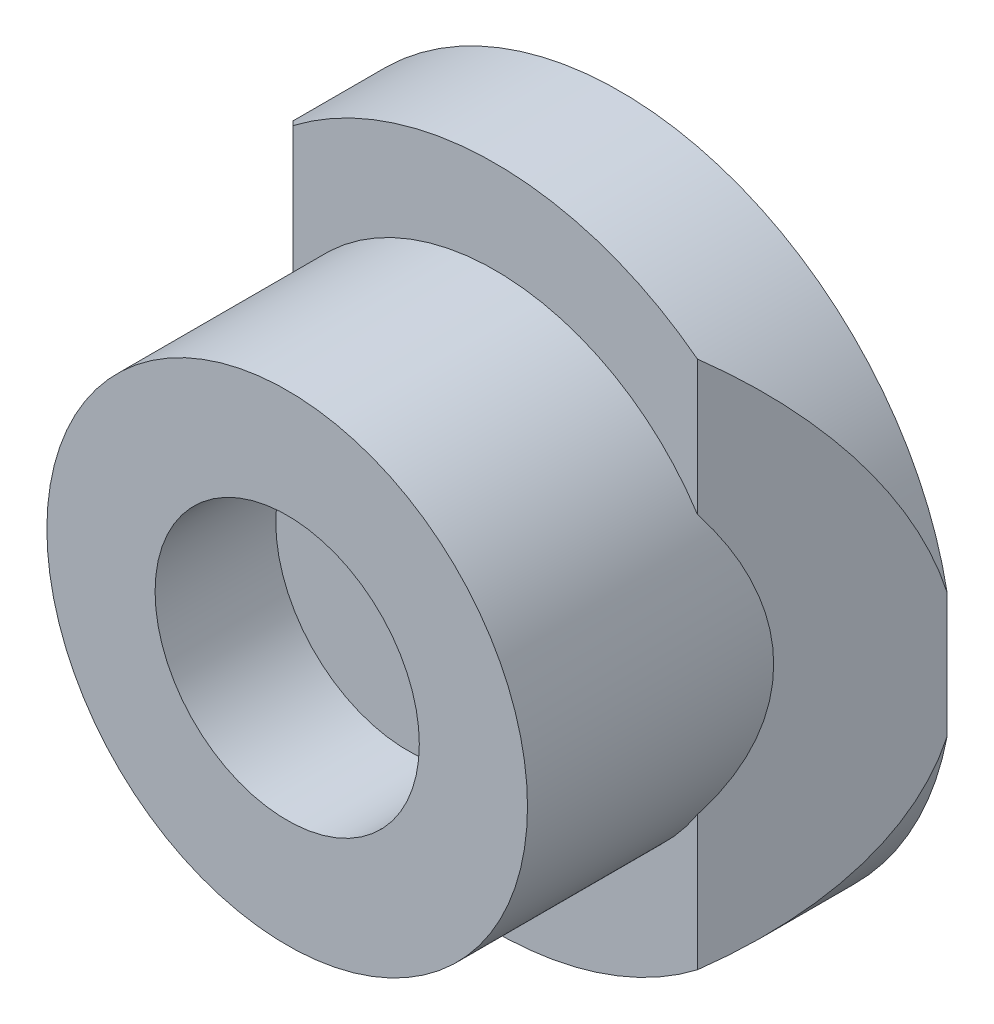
ISO-10303-21;
HEADER;
FILE_DESCRIPTION(('STEP AP214'),'2;1');
FILE_NAME('part.step','',(''),(''),'','','');
FILE_SCHEMA(('AUTOMOTIVE_DESIGN { 1 0 10303 214 1 1 1 1 }'));
ENDSEC;
DATA;
#1=APPLICATION_CONTEXT('core data for automotive mechanical design processes');
#2=APPLICATION_PROTOCOL_DEFINITION('international standard','automotive_design',2000,#1);
#3=PRODUCT_CONTEXT('',#1,'mechanical');
#4=PRODUCT('Part','Part','',(#3));
#5=PRODUCT_RELATED_PRODUCT_CATEGORY('part','',(#4));
#6=PRODUCT_DEFINITION_FORMATION('','',#4);
#7=PRODUCT_DEFINITION_CONTEXT('part definition',#1,'design');
#8=PRODUCT_DEFINITION('design','',#6,#7);
#9=PRODUCT_DEFINITION_SHAPE('','',#8);
#10=(LENGTH_UNIT() NAMED_UNIT(*) SI_UNIT(.MILLI.,.METRE.));
#11=(NAMED_UNIT(*) PLANE_ANGLE_UNIT() SI_UNIT($,.RADIAN.));
#12=(NAMED_UNIT(*) SI_UNIT($,.STERADIAN.) SOLID_ANGLE_UNIT());
#13=UNCERTAINTY_MEASURE_WITH_UNIT(LENGTH_MEASURE(1.E-05),#10,'distance_accuracy_value','');
#14=(GEOMETRIC_REPRESENTATION_CONTEXT(3) GLOBAL_UNCERTAINTY_ASSIGNED_CONTEXT((#13)) GLOBAL_UNIT_ASSIGNED_CONTEXT((#10,
#11,#12)) REPRESENTATION_CONTEXT('',''));
#15=CARTESIAN_POINT('',(0.,0.,0.));
#16=DIRECTION('',(0.,0.,1.));
#17=DIRECTION('',(1.,0.,0.));
#18=AXIS2_PLACEMENT_3D('',#15,#16,#17);
#19=CARTESIAN_POINT('',(0.,0.,-3.));
#20=DIRECTION('',(0.,0.,1.));
#21=DIRECTION('',(1.,0.,0.));
#22=AXIS2_PLACEMENT_3D('',#19,#20,#21);
#23=CYLINDRICAL_SURFACE('',#22,8.);
#24=CARTESIAN_POINT('',(0.,0.,4.85857864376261));
#25=DIRECTION('',(0.707106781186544,0.,-0.707106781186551));
#26=DIRECTION('',(0.707106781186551,0.,0.707106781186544));
#27=AXIS2_PLACEMENT_3D('',#24,#25,#26);
#28=ELLIPSE('',#27,11.3137084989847,8.);
#29=CARTESIAN_POINT('',(-7.85857864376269,-1.49757861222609,-3.));
#30=VERTEX_POINT('',#29);
#31=CARTESIAN_POINT('',(-4.85857864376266,-6.35564422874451,0.));
#32=VERTEX_POINT('',#31);
#33=EDGE_CURVE('E112',#30,#32,#28,.F.);
#34=ORIENTED_EDGE('',*,*,#33,.F.);
#35=CARTESIAN_POINT('',(0.,0.,-3.));
#36=DIRECTION('',(0.,0.,1.));
#37=DIRECTION('',(1.,0.,0.));
#38=AXIS2_PLACEMENT_3D('',#35,#36,#37);
#39=CIRCLE('',#38,8.);
#40=CARTESIAN_POINT('',(7.85857864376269,-1.49757861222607,-3.));
#41=VERTEX_POINT('',#40);
#42=EDGE_CURVE('E124',#30,#41,#39,.T.);
#43=ORIENTED_EDGE('',*,*,#42,.T.);
#44=CARTESIAN_POINT('',(0.,0.,4.85857864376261));
#45=DIRECTION('',(-0.707106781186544,0.,-0.707106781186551));
#46=DIRECTION('',(-0.707106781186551,0.,0.707106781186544));
#47=AXIS2_PLACEMENT_3D('',#44,#45,#46);
#48=ELLIPSE('',#47,11.3137084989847,8.);
#49=CARTESIAN_POINT('',(4.85857864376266,-6.35564422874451,0.));
#50=VERTEX_POINT('',#49);
#51=EDGE_CURVE('E119',#50,#41,#48,.F.);
#52=ORIENTED_EDGE('',*,*,#51,.F.);
#53=CARTESIAN_POINT('',(0.,0.,0.));
#54=DIRECTION('',(0.,0.,1.));
#55=DIRECTION('',(1.,0.,0.));
#56=AXIS2_PLACEMENT_3D('',#53,#54,#55);
#57=CIRCLE('',#56,8.);
#58=EDGE_CURVE('E117',#32,#50,#57,.T.);
#59=ORIENTED_EDGE('',*,*,#58,.F.);
#60=EDGE_LOOP('',(#34,#43,#52,#59));
#61=FACE_BOUND('',#60,.T.);
#62=ADVANCED_FACE('F33',(#61),#23,.T.);
#63=CARTESIAN_POINT('',(0.,0.,0.));
#64=DIRECTION('',(0.,0.,1.));
#65=DIRECTION('',(1.,0.,0.));
#66=AXIS2_PLACEMENT_3D('',#63,#64,#65);
#67=PLANE('',#66);
#68=DIRECTION('',(0.,1.,0.));
#69=VECTOR('',#68,1.);
#70=CARTESIAN_POINT('',(-4.85857864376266,0.,0.));
#71=LINE('',#70,#69);
#72=CARTESIAN_POINT('',(-4.85857864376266,-3.12167239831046,0.));
#73=VERTEX_POINT('',#72);
#74=EDGE_CURVE('E41',#32,#73,#71,.T.);
#75=ORIENTED_EDGE('',*,*,#74,.F.);
#76=ORIENTED_EDGE('',*,*,#58,.T.);
#77=DIRECTION('',(0.,-1.,0.));
#78=VECTOR('',#77,1.);
#79=CARTESIAN_POINT('',(4.85857864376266,0.,0.));
#80=LINE('',#79,#78);
#81=CARTESIAN_POINT('',(4.85857864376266,-3.12167239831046,0.));
#82=VERTEX_POINT('',#81);
#83=EDGE_CURVE('E99',#82,#50,#80,.T.);
#84=ORIENTED_EDGE('',*,*,#83,.F.);
#85=CARTESIAN_POINT('',(0.,0.,0.));
#86=DIRECTION('',(0.,0.,1.));
#87=DIRECTION('',(1.,0.,0.));
#88=AXIS2_PLACEMENT_3D('',#85,#86,#87);
#89=CIRCLE('',#88,5.775);
#90=EDGE_CURVE('E87',#73,#82,#89,.T.);
#91=ORIENTED_EDGE('',*,*,#90,.F.);
#92=EDGE_LOOP('',(#75,#76,#84,#91));
#93=FACE_BOUND('',#92,.T.);
#94=ADVANCED_FACE('F116',(#93),#67,.T.);
#95=CARTESIAN_POINT('',(0.,0.,5.));
#96=DIRECTION('',(0.,0.,-1.));
#97=DIRECTION('',(-1.,0.,0.));
#98=AXIS2_PLACEMENT_3D('',#95,#96,#97);
#99=CYLINDRICAL_SURFACE('',#98,5.775);
#100=CARTESIAN_POINT('',(0.,0.,5.));
#101=DIRECTION('',(0.,0.,1.));
#102=DIRECTION('',(1.,0.,0.));
#103=AXIS2_PLACEMENT_3D('',#100,#101,#102);
#104=CIRCLE('',#103,5.775);
#105=CARTESIAN_POINT('',(5.775,0.,5.));
#106=VERTEX_POINT('',#105);
#107=EDGE_CURVE('E102',#106,#106,#104,.T.);
#108=ORIENTED_EDGE('',*,*,#107,.F.);
#109=EDGE_LOOP('',(#108));
#110=FACE_BOUND('',#109,.T.);
#111=CARTESIAN_POINT('',(4.85857864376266,3.12167239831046,0.));
#112=VERTEX_POINT('',#111);
#113=CARTESIAN_POINT('',(-4.85857864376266,3.12167239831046,0.));
#114=VERTEX_POINT('',#113);
#115=EDGE_CURVE('E85',#112,#114,#89,.T.);
#116=ORIENTED_EDGE('',*,*,#115,.T.);
#117=CARTESIAN_POINT('',(0.,0.,4.85857864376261));
#118=DIRECTION('',(0.707106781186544,0.,-0.707106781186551));
#119=DIRECTION('',(0.707106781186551,0.,0.707106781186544));
#120=AXIS2_PLACEMENT_3D('',#117,#118,#119);
#121=ELLIPSE('',#120,8.16708332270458,5.775);
#122=EDGE_CURVE('E11',#73,#114,#121,.T.);
#123=ORIENTED_EDGE('',*,*,#122,.F.);
#124=ORIENTED_EDGE('',*,*,#90,.T.);
#125=CARTESIAN_POINT('',(0.,0.,4.85857864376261));
#126=DIRECTION('',(-0.707106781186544,0.,-0.707106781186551));
#127=DIRECTION('',(-0.707106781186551,0.,0.707106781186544));
#128=AXIS2_PLACEMENT_3D('',#125,#126,#127);
#129=ELLIPSE('',#128,8.16708332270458,5.775);
#130=EDGE_CURVE('E48',#112,#82,#129,.T.);
#131=ORIENTED_EDGE('',*,*,#130,.F.);
#132=EDGE_LOOP('',(#116,#123,#124,#131));
#133=FACE_BOUND('',#132,.T.);
#134=ADVANCED_FACE('F35',(#110,#133),#99,.T.);
#135=CARTESIAN_POINT('',(0.,0.,5.));
#136=DIRECTION('',(0.,0.,1.));
#137=DIRECTION('',(1.,0.,0.));
#138=AXIS2_PLACEMENT_3D('',#135,#136,#137);
#139=PLANE('',#138);
#140=CARTESIAN_POINT('',(0.,0.,5.));
#141=DIRECTION('',(0.,0.,1.));
#142=DIRECTION('',(1.,0.,0.));
#143=AXIS2_PLACEMENT_3D('',#140,#141,#142);
#144=CIRCLE('',#143,3.175);
#145=CARTESIAN_POINT('',(3.175,0.,5.));
#146=VERTEX_POINT('',#145);
#147=EDGE_CURVE('E135',#146,#146,#144,.T.);
#148=ORIENTED_EDGE('',*,*,#147,.F.);
#149=EDGE_LOOP('',(#148));
#150=FACE_BOUND('',#149,.T.);
#151=ORIENTED_EDGE('',*,*,#107,.T.);
#152=EDGE_LOOP('',(#151));
#153=FACE_BOUND('',#152,.T.);
#154=ADVANCED_FACE('F154',(#150,#153),#139,.T.);
#155=CARTESIAN_POINT('',(-4.85857864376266,6.35564422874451,0.));
#156=VERTEX_POINT('',#155);
#157=CARTESIAN_POINT('',(-7.85857864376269,1.49757861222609,-3.));
#158=VERTEX_POINT('',#157);
#159=EDGE_CURVE('E126',#156,#158,#28,.F.);
#160=ORIENTED_EDGE('',*,*,#159,.F.);
#161=CARTESIAN_POINT('',(4.85857864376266,6.35564422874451,0.));
#162=VERTEX_POINT('',#161);
#163=EDGE_CURVE('E138',#162,#156,#57,.T.);
#164=ORIENTED_EDGE('',*,*,#163,.F.);
#165=CARTESIAN_POINT('',(7.85857864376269,1.49757861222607,-3.));
#166=VERTEX_POINT('',#165);
#167=EDGE_CURVE('E94',#166,#162,#48,.F.);
#168=ORIENTED_EDGE('',*,*,#167,.F.);
#169=EDGE_CURVE('E106',#166,#158,#39,.T.);
#170=ORIENTED_EDGE('',*,*,#169,.T.);
#171=EDGE_LOOP('',(#160,#164,#168,#170));
#172=FACE_BOUND('',#171,.T.);
#173=ADVANCED_FACE('F140',(#172),#23,.T.);
#174=CARTESIAN_POINT('',(0.,0.,-3.));
#175=DIRECTION('',(0.,0.,1.));
#176=DIRECTION('',(1.,0.,0.));
#177=AXIS2_PLACEMENT_3D('',#174,#175,#176);
#178=PLANE('',#177);
#179=ORIENTED_EDGE('',*,*,#42,.F.);
#180=DIRECTION('',(0.,1.,0.));
#181=VECTOR('',#180,1.);
#182=CARTESIAN_POINT('',(-7.85857864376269,-8.,-3.));
#183=LINE('',#182,#181);
#184=EDGE_CURVE('E128',#30,#158,#183,.T.);
#185=ORIENTED_EDGE('',*,*,#184,.T.);
#186=ORIENTED_EDGE('',*,*,#169,.F.);
#187=DIRECTION('',(0.,1.,0.));
#188=VECTOR('',#187,1.);
#189=CARTESIAN_POINT('',(7.85857864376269,-8.,-3.));
#190=LINE('',#189,#188);
#191=EDGE_CURVE('E88',#41,#166,#190,.T.);
#192=ORIENTED_EDGE('',*,*,#191,.F.);
#193=EDGE_LOOP('',(#179,#185,#186,#192));
#194=FACE_BOUND('',#193,.T.);
#195=ADVANCED_FACE('F145',(#194),#178,.F.);
#196=EDGE_CURVE('E98',#114,#156,#71,.T.);
#197=ORIENTED_EDGE('',*,*,#196,.F.);
#198=ORIENTED_EDGE('',*,*,#115,.F.);
#199=EDGE_CURVE('E91',#162,#112,#80,.T.);
#200=ORIENTED_EDGE('',*,*,#199,.F.);
#201=ORIENTED_EDGE('',*,*,#163,.T.);
#202=EDGE_LOOP('',(#197,#198,#200,#201));
#203=FACE_BOUND('',#202,.T.);
#204=ADVANCED_FACE('F101',(#203),#67,.T.);
#205=CARTESIAN_POINT('',(0.,0.,2.1));
#206=DIRECTION('',(0.,0.,1.));
#207=DIRECTION('',(1.,0.,0.));
#208=AXIS2_PLACEMENT_3D('',#205,#206,#207);
#209=CYLINDRICAL_SURFACE('',#208,3.175);
#210=CARTESIAN_POINT('',(0.,0.,2.1));
#211=DIRECTION('',(0.,0.,1.));
#212=DIRECTION('',(1.,0.,0.));
#213=AXIS2_PLACEMENT_3D('',#210,#211,#212);
#214=CIRCLE('',#213,3.175);
#215=CARTESIAN_POINT('',(3.175,0.,2.1));
#216=VERTEX_POINT('',#215);
#217=EDGE_CURVE('E132',#216,#216,#214,.T.);
#218=ORIENTED_EDGE('',*,*,#217,.F.);
#219=EDGE_LOOP('',(#218));
#220=FACE_BOUND('',#219,.T.);
#221=ORIENTED_EDGE('',*,*,#147,.T.);
#222=EDGE_LOOP('',(#221));
#223=FACE_BOUND('',#222,.T.);
#224=ADVANCED_FACE('F152',(#220,#223),#209,.F.);
#225=CARTESIAN_POINT('',(0.,0.,2.1));
#226=DIRECTION('',(0.,0.,1.));
#227=DIRECTION('',(1.,0.,0.));
#228=AXIS2_PLACEMENT_3D('',#225,#226,#227);
#229=PLANE('',#228);
#230=ORIENTED_EDGE('',*,*,#217,.T.);
#231=EDGE_LOOP('',(#230));
#232=FACE_BOUND('',#231,.T.);
#233=ADVANCED_FACE('F172',(#232),#229,.T.);
#234=CARTESIAN_POINT('',(7.85857864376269,-8.,-3.));
#235=DIRECTION('',(-0.707106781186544,0.,-0.707106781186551));
#236=DIRECTION('',(-0.707106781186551,0.,0.707106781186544));
#237=AXIS2_PLACEMENT_3D('',#234,#235,#236);
#238=PLANE('',#237);
#239=ORIENTED_EDGE('',*,*,#199,.T.);
#240=ORIENTED_EDGE('',*,*,#130,.T.);
#241=ORIENTED_EDGE('',*,*,#83,.T.);
#242=ORIENTED_EDGE('',*,*,#51,.T.);
#243=ORIENTED_EDGE('',*,*,#191,.T.);
#244=ORIENTED_EDGE('',*,*,#167,.T.);
#245=EDGE_LOOP('',(#239,#240,#241,#242,#243,#244));
#246=FACE_BOUND('',#245,.T.);
#247=ADVANCED_FACE('F92',(#246),#238,.F.);
#248=CARTESIAN_POINT('',(-4.85857864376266,-8.,0.));
#249=DIRECTION('',(0.707106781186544,0.,-0.707106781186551));
#250=DIRECTION('',(-0.707106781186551,0.,-0.707106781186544));
#251=AXIS2_PLACEMENT_3D('',#248,#249,#250);
#252=PLANE('',#251);
#253=ORIENTED_EDGE('',*,*,#74,.T.);
#254=ORIENTED_EDGE('',*,*,#122,.T.);
#255=ORIENTED_EDGE('',*,*,#196,.T.);
#256=ORIENTED_EDGE('',*,*,#159,.T.);
#257=ORIENTED_EDGE('',*,*,#184,.F.);
#258=ORIENTED_EDGE('',*,*,#33,.T.);
#259=EDGE_LOOP('',(#253,#254,#255,#256,#257,#258));
#260=FACE_BOUND('',#259,.T.);
#261=ADVANCED_FACE('F110',(#260),#252,.F.);
#262=CLOSED_SHELL('',(#62,#94,#134,#154,#173,#195,#204,#224,#233,#247,#261));
#263=MANIFOLD_SOLID_BREP('B2',#262);
#264=ADVANCED_BREP_SHAPE_REPRESENTATION('',(#18,#263),#14);
#265=SHAPE_DEFINITION_REPRESENTATION(#9,#264);
ENDSEC;
END-ISO-10303-21;
